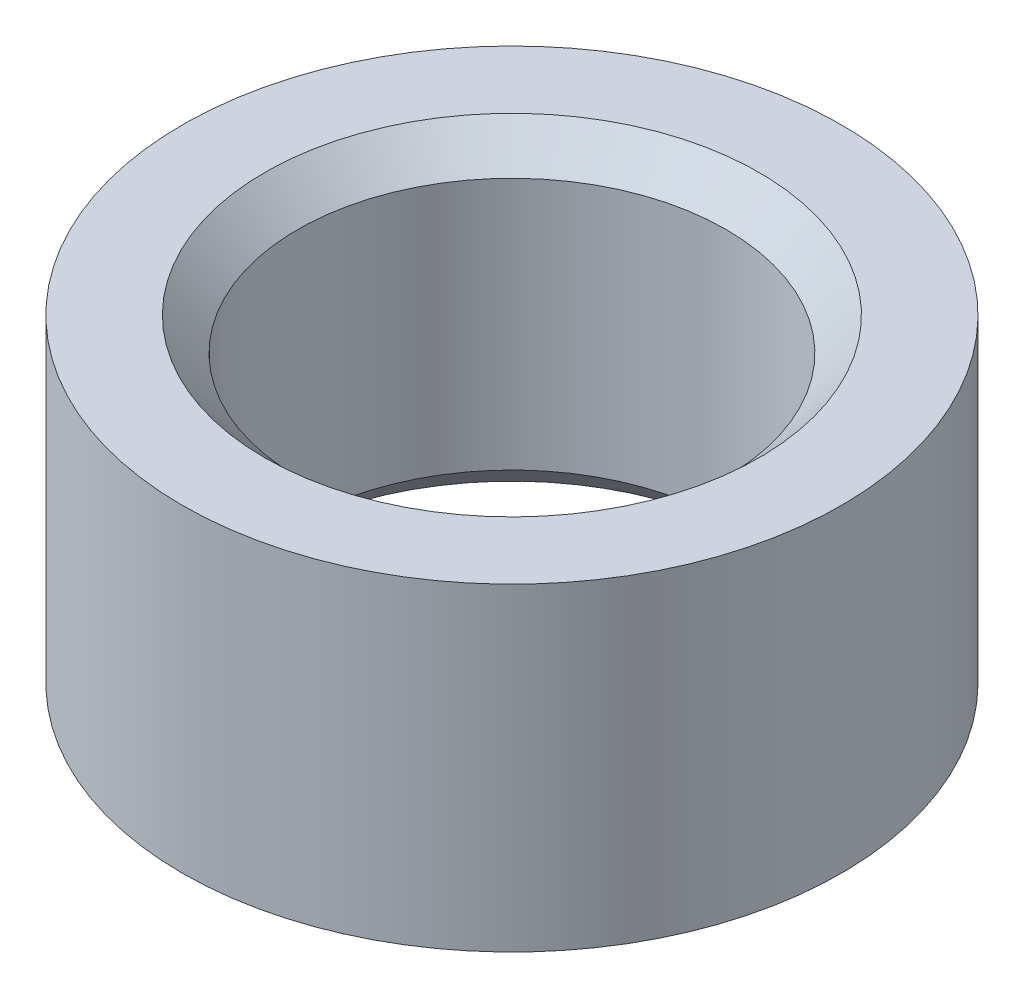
ISO-10303-21;
HEADER;
FILE_DESCRIPTION(('STEP AP214'),'2;1');
FILE_NAME('part.step','',(''),(''),'','','');
FILE_SCHEMA(('AUTOMOTIVE_DESIGN { 1 0 10303 214 1 1 1 1 }'));
ENDSEC;
DATA;
#1=APPLICATION_CONTEXT('core data for automotive mechanical design processes');
#2=APPLICATION_PROTOCOL_DEFINITION('international standard','automotive_design',2000,#1);
#3=PRODUCT_CONTEXT('',#1,'mechanical');
#4=PRODUCT('Part','Part','',(#3));
#5=PRODUCT_RELATED_PRODUCT_CATEGORY('part','',(#4));
#6=PRODUCT_DEFINITION_FORMATION('','',#4);
#7=PRODUCT_DEFINITION_CONTEXT('part definition',#1,'design');
#8=PRODUCT_DEFINITION('design','',#6,#7);
#9=PRODUCT_DEFINITION_SHAPE('','',#8);
#10=(LENGTH_UNIT() NAMED_UNIT(*) SI_UNIT(.MILLI.,.METRE.));
#11=(NAMED_UNIT(*) PLANE_ANGLE_UNIT() SI_UNIT($,.RADIAN.));
#12=(NAMED_UNIT(*) SI_UNIT($,.STERADIAN.) SOLID_ANGLE_UNIT());
#13=UNCERTAINTY_MEASURE_WITH_UNIT(LENGTH_MEASURE(1.E-05),#10,'distance_accuracy_value','');
#14=(GEOMETRIC_REPRESENTATION_CONTEXT(3) GLOBAL_UNCERTAINTY_ASSIGNED_CONTEXT((#13)) GLOBAL_UNIT_ASSIGNED_CONTEXT((#10,
#11,#12)) REPRESENTATION_CONTEXT('',''));
#15=CARTESIAN_POINT('',(0.,0.,0.));
#16=DIRECTION('',(0.,0.,1.));
#17=DIRECTION('',(1.,0.,0.));
#18=AXIS2_PLACEMENT_3D('',#15,#16,#17);
#19=CARTESIAN_POINT('',(0.,14.5,0.));
#20=DIRECTION('',(0.,1.,0.));
#21=DIRECTION('',(0.,0.,1.));
#22=AXIS2_PLACEMENT_3D('',#19,#20,#21);
#23=PLANE('',#22);
#24=CARTESIAN_POINT('',(0.,14.5,0.));
#25=DIRECTION('',(0.,1.,0.));
#26=DIRECTION('',(0.,0.,1.));
#27=AXIS2_PLACEMENT_3D('',#24,#25,#26);
#28=CIRCLE('',#27,11.25);
#29=CARTESIAN_POINT('',(0.,14.5,11.25));
#30=VERTEX_POINT('',#29);
#31=EDGE_CURVE('E10',#30,#30,#28,.F.);
#32=ORIENTED_EDGE('',*,*,#31,.T.);
#33=EDGE_LOOP('',(#32));
#34=FACE_BOUND('',#33,.T.);
#35=CARTESIAN_POINT('',(0.,14.5,0.));
#36=DIRECTION('',(0.,1.,0.));
#37=DIRECTION('',(0.,0.,1.));
#38=AXIS2_PLACEMENT_3D('',#35,#36,#37);
#39=CIRCLE('',#38,15.);
#40=CARTESIAN_POINT('',(0.,14.5,15.));
#41=VERTEX_POINT('',#40);
#42=EDGE_CURVE('E34',#41,#41,#39,.T.);
#43=ORIENTED_EDGE('',*,*,#42,.T.);
#44=EDGE_LOOP('',(#43));
#45=FACE_BOUND('',#44,.T.);
#46=ADVANCED_FACE('F14',(#34,#45),#23,.T.);
#47=CARTESIAN_POINT('',(0.,0.,0.));
#48=DIRECTION('',(0.,1.,0.));
#49=DIRECTION('',(0.,0.,1.));
#50=AXIS2_PLACEMENT_3D('',#47,#48,#49);
#51=PLANE('',#50);
#52=CARTESIAN_POINT('',(0.,0.,0.));
#53=DIRECTION('',(0.,1.,0.));
#54=DIRECTION('',(0.,0.,1.));
#55=AXIS2_PLACEMENT_3D('',#52,#53,#54);
#56=CIRCLE('',#55,11.25);
#57=CARTESIAN_POINT('',(0.,0.,11.25));
#58=VERTEX_POINT('',#57);
#59=EDGE_CURVE('E29',#58,#58,#56,.T.);
#60=ORIENTED_EDGE('',*,*,#59,.T.);
#61=EDGE_LOOP('',(#60));
#62=FACE_BOUND('',#61,.T.);
#63=CARTESIAN_POINT('',(0.,0.,0.));
#64=DIRECTION('',(0.,1.,0.));
#65=DIRECTION('',(0.,0.,1.));
#66=AXIS2_PLACEMENT_3D('',#63,#64,#65);
#67=CIRCLE('',#66,15.);
#68=CARTESIAN_POINT('',(0.,0.,15.));
#69=VERTEX_POINT('',#68);
#70=EDGE_CURVE('E37',#69,#69,#67,.T.);
#71=ORIENTED_EDGE('',*,*,#70,.F.);
#72=EDGE_LOOP('',(#71));
#73=FACE_BOUND('',#72,.T.);
#74=ADVANCED_FACE('F42',(#62,#73),#51,.F.);
#75=CARTESIAN_POINT('',(0.,14.5,0.));
#76=DIRECTION('',(0.,-1.,0.));
#77=DIRECTION('',(0.,0.,-1.));
#78=AXIS2_PLACEMENT_3D('',#75,#76,#77);
#79=CYLINDRICAL_SURFACE('',#78,15.);
#80=ORIENTED_EDGE('',*,*,#42,.F.);
#81=EDGE_LOOP('',(#80));
#82=FACE_BOUND('',#81,.T.);
#83=ORIENTED_EDGE('',*,*,#70,.T.);
#84=EDGE_LOOP('',(#83));
#85=FACE_BOUND('',#84,.T.);
#86=ADVANCED_FACE('F16',(#82,#85),#79,.T.);
#87=CARTESIAN_POINT('',(0.,14.5,0.));
#88=DIRECTION('',(0.,-1.,0.));
#89=DIRECTION('',(0.,0.,-1.));
#90=AXIS2_PLACEMENT_3D('',#87,#88,#89);
#91=CYLINDRICAL_SURFACE('',#90,9.75);
#92=CARTESIAN_POINT('',(0.,1.5,0.));
#93=DIRECTION('',(0.,1.,0.));
#94=DIRECTION('',(0.,0.,1.));
#95=AXIS2_PLACEMENT_3D('',#92,#93,#94);
#96=CIRCLE('',#95,9.75);
#97=CARTESIAN_POINT('',(0.,1.5,9.75));
#98=VERTEX_POINT('',#97);
#99=EDGE_CURVE('E21',#98,#98,#96,.F.);
#100=ORIENTED_EDGE('',*,*,#99,.T.);
#101=EDGE_LOOP('',(#100));
#102=FACE_BOUND('',#101,.T.);
#103=CARTESIAN_POINT('',(0.,13.,0.));
#104=DIRECTION('',(0.,1.,0.));
#105=DIRECTION('',(0.,0.,1.));
#106=AXIS2_PLACEMENT_3D('',#103,#104,#105);
#107=CIRCLE('',#106,9.75);
#108=CARTESIAN_POINT('',(0.,13.,9.75));
#109=VERTEX_POINT('',#108);
#110=EDGE_CURVE('E25',#109,#109,#107,.T.);
#111=ORIENTED_EDGE('',*,*,#110,.T.);
#112=EDGE_LOOP('',(#111));
#113=FACE_BOUND('',#112,.T.);
#114=ADVANCED_FACE('F52',(#102,#113),#91,.F.);
#115=CARTESIAN_POINT('',(0.,0.,0.));
#116=DIRECTION('',(0.,-1.,0.));
#117=DIRECTION('',(0.,0.,-1.));
#118=AXIS2_PLACEMENT_3D('',#115,#116,#117);
#119=CONICAL_SURFACE('',#118,11.25,0.785398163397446);
#120=ORIENTED_EDGE('',*,*,#99,.F.);
#121=EDGE_LOOP('',(#120));
#122=FACE_BOUND('',#121,.T.);
#123=ORIENTED_EDGE('',*,*,#59,.F.);
#124=EDGE_LOOP('',(#123));
#125=FACE_BOUND('',#124,.T.);
#126=ADVANCED_FACE('F57',(#122,#125),#119,.F.);
#127=CARTESIAN_POINT('',(0.,13.,0.));
#128=DIRECTION('',(0.,1.,0.));
#129=DIRECTION('',(0.,0.,1.));
#130=AXIS2_PLACEMENT_3D('',#127,#128,#129);
#131=CONICAL_SURFACE('',#130,9.75,0.785398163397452);
#132=ORIENTED_EDGE('',*,*,#31,.F.);
#133=EDGE_LOOP('',(#132));
#134=FACE_BOUND('',#133,.T.);
#135=ORIENTED_EDGE('',*,*,#110,.F.);
#136=EDGE_LOOP('',(#135));
#137=FACE_BOUND('',#136,.T.);
#138=ADVANCED_FACE('F60',(#134,#137),#131,.F.);
#139=CLOSED_SHELL('',(#46,#74,#86,#114,#126,#138));
#140=MANIFOLD_SOLID_BREP('B1',#139);
#141=ADVANCED_BREP_SHAPE_REPRESENTATION('',(#18,#140),#14);
#142=SHAPE_DEFINITION_REPRESENTATION(#9,#141);
ENDSEC;
END-ISO-10303-21;
